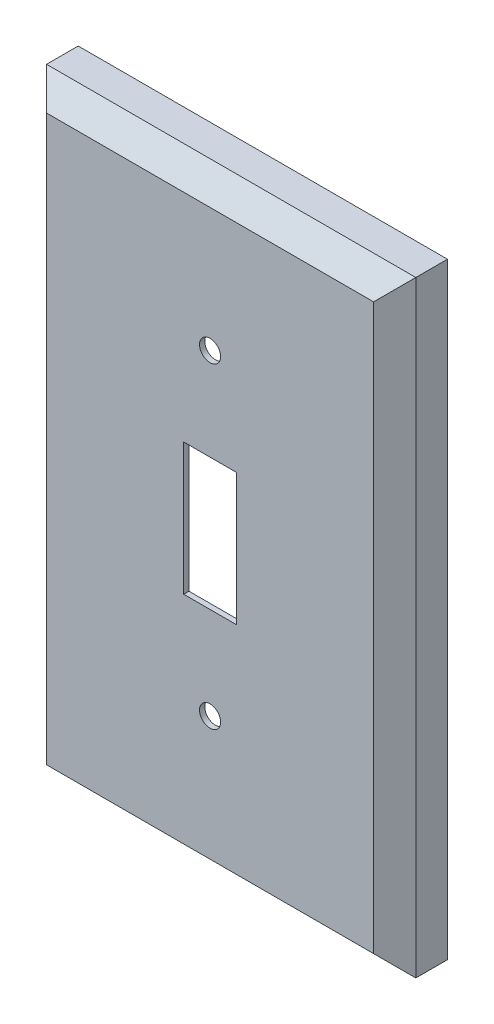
from build123d import *

# Parameters (mm, degrees)
SKETCH1_W          = 70
SKETCH1_H          = 115
BASE_EXTRUDE_DEPTH = 10
CHAMFER2_SIZE      = 4
SHELL1_T           = -1
SKETCH3_W          = 10
SKETCH3_H          = 25
SWITCHHOLE_DEPTH   = 136
SKETCH4_R          = 2
SCREWHOLE_DEPTH    = 136


with BuildPart() as part:
    # Sketch1 → Base-Extrude (new body)
    with BuildSketch(Plane.XY):
        with Locations((35, 57.5)):
            Rectangle(SKETCH1_W, SKETCH1_H)
    extrude(amount=BASE_EXTRUDE_DEPTH)

    # Chamfer2
    chamfer2_edges = [part.edges().sort_by_distance(p)[0] for p in [
        (70, 57.5, 10),
        (35, 115, 10),
        (0, 57.5, 10),
        (35, 0, 10),
    ]]
    chamfer(chamfer2_edges, length=CHAMFER2_SIZE)

    # Shell1
    shell1_openings = [part.faces().sort_by_distance(p)[0] for p in [
        (35, 57.5, 0),
    ]]
    offset(amount=SHELL1_T, openings=shell1_openings, kind=Kind.INTERSECTION)

    # Sketch3 → switchhole (cut, through all)
    with BuildSketch(Plane(origin=(0, 0, 0), x_dir=(-1, 0, 0), z_dir=(0, 0, -1))):
        with Locations((-35, 57.5)):
            Rectangle(SKETCH3_W, SKETCH3_H)
    extrude(amount=-SWITCHHOLE_DEPTH, mode=Mode.SUBTRACT)

    # Sketch4 → screwhole (cut, through all)
    with BuildSketch(Plane(origin=(0, 0, 0), x_dir=(-1, 0, 0), z_dir=(0, 0, -1))):
        with Locations((-35, 87.5)):
            Circle(SKETCH4_R)
        with Locations((-35, 27.5)):
            Circle(SKETCH4_R)
    extrude(amount=-SCREWHOLE_DEPTH, mode=Mode.SUBTRACT)


solid = part.part
